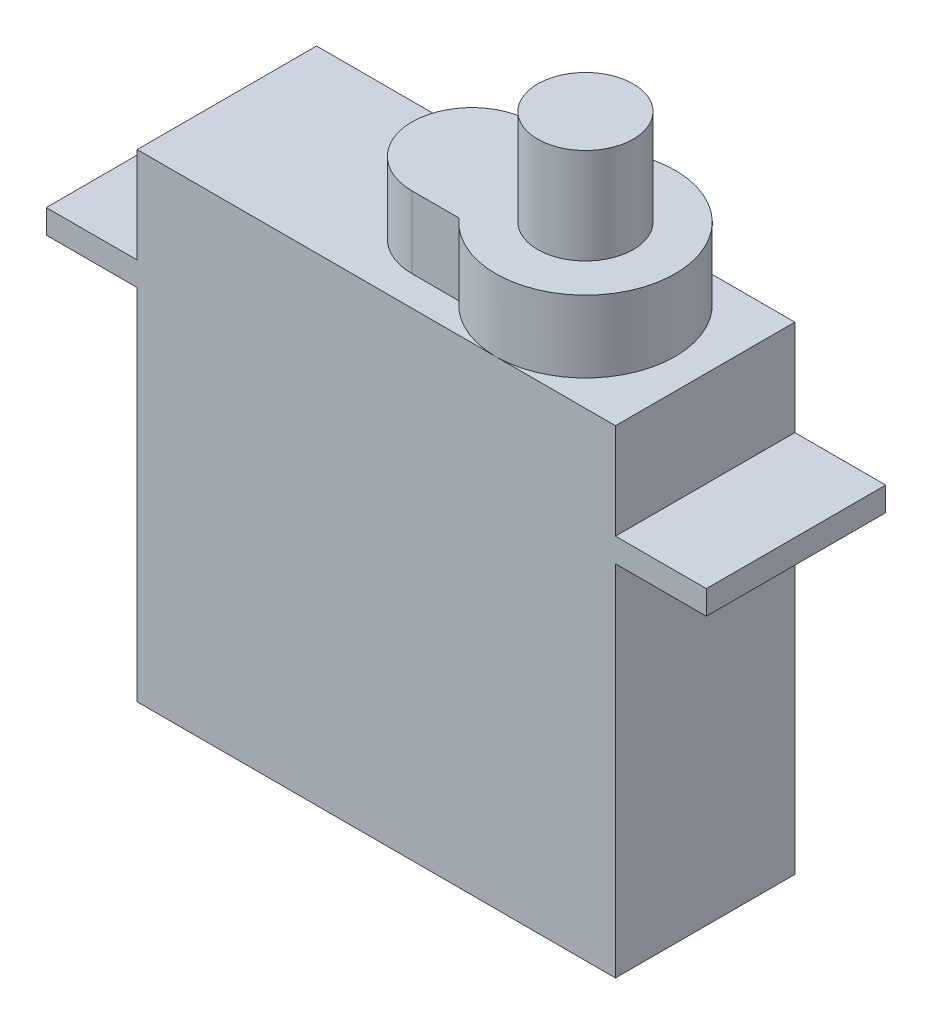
from build123d import *

# Parameters (mm, degrees)
BOSS_EXTRU_1_DEPTH      = 7.5
ESQUISSE2_OUTSIDE_W     = 36.94
ESQUISSE2_OUTSIDE_H     = 16.84
ENL_V_MAT_EXTRU_1_DEPTH = 3
ESQUISSE3_R             = 2
BOSS_EXTRU_2_DEPTH      = 4


with BuildPart() as part:
    # Esquisse1 → Boss.-Extru.1 (new body)
    with BuildSketch(Plane.XY):
        Polygon((0, 0), (20, 0), (20, 15), (23.8, 15), (23.8, 16), (20, 16), (20, 20), (18.744988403, 20), (18.744988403, 23), (7.744988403, 23), (7.744988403, 20), (0, 20), (0, 16), (-3.8, 16), (-3.8, 15), (0, 15), align=None)
    extrude(amount=BOSS_EXTRU_1_DEPTH)

    # Esquisse2 outside → Enl_v. mat.-Extru.1 (cut)
    with BuildSketch(Plane(origin=(0, 23, 0), x_dir=(1, 0, 0), z_dir=(0, 1, 0))):
        with Locations((10, -3.75)):
            Rectangle(ESQUISSE2_OUTSIDE_W, ESQUISSE2_OUTSIDE_H)
        with BuildLine():
            Line((10.244988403, -1.25), (12.199903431, -1.25))
            ThreePointArc((12.199903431, -1.25), (18.744988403, -3.75), (12.199903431, -6.25))
            Line((12.199903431, -6.25), (10.244988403, -6.25))
            ThreePointArc((10.244988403, -6.25), (7.744988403, -3.75), (10.244988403, -1.25))
        make_face(mode=Mode.SUBTRACT)
    extrude(amount=-ENL_V_MAT_EXTRU_1_DEPTH, mode=Mode.SUBTRACT)

    # Esquisse3 → Boss.-Extru.2 (add)
    with BuildSketch(Plane(origin=(0, 23, 0), x_dir=(1, 0, 0), z_dir=(0, 1, 0))):
        with Locations(Location((14.994988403, -3.75, 0), (0, 0, 270))):
            Circle(ESQUISSE3_R)
    extrude(amount=BOSS_EXTRU_2_DEPTH)


solid = part.part
